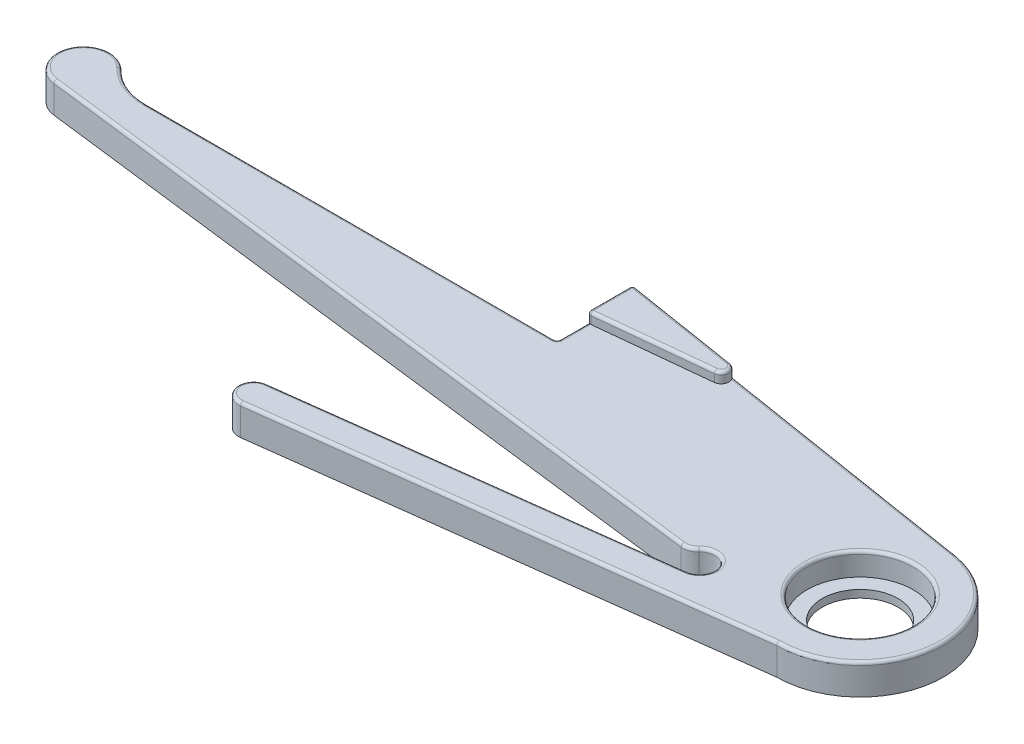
ISO-10303-21;
HEADER;
FILE_DESCRIPTION(('STEP AP214'),'2;1');
FILE_NAME('part.step','',(''),(''),'','','');
FILE_SCHEMA(('AUTOMOTIVE_DESIGN { 1 0 10303 214 1 1 1 1 }'));
ENDSEC;
DATA;
#1=APPLICATION_CONTEXT('core data for automotive mechanical design processes');
#2=APPLICATION_PROTOCOL_DEFINITION('international standard','automotive_design',2000,#1);
#3=PRODUCT_CONTEXT('',#1,'mechanical');
#4=PRODUCT('Part','Part','',(#3));
#5=PRODUCT_RELATED_PRODUCT_CATEGORY('part','',(#4));
#6=PRODUCT_DEFINITION_FORMATION('','',#4);
#7=PRODUCT_DEFINITION_CONTEXT('part definition',#1,'design');
#8=PRODUCT_DEFINITION('design','',#6,#7);
#9=PRODUCT_DEFINITION_SHAPE('','',#8);
#10=(LENGTH_UNIT() NAMED_UNIT(*) SI_UNIT(.MILLI.,.METRE.));
#11=(NAMED_UNIT(*) PLANE_ANGLE_UNIT() SI_UNIT($,.RADIAN.));
#12=(NAMED_UNIT(*) SI_UNIT($,.STERADIAN.) SOLID_ANGLE_UNIT());
#13=UNCERTAINTY_MEASURE_WITH_UNIT(LENGTH_MEASURE(1.E-05),#10,'distance_accuracy_value','');
#14=(GEOMETRIC_REPRESENTATION_CONTEXT(3) GLOBAL_UNCERTAINTY_ASSIGNED_CONTEXT((#13)) GLOBAL_UNIT_ASSIGNED_CONTEXT((#10,
#11,#12)) REPRESENTATION_CONTEXT('',''));
#15=CARTESIAN_POINT('',(0.,0.,0.));
#16=DIRECTION('',(0.,0.,1.));
#17=DIRECTION('',(1.,0.,0.));
#18=AXIS2_PLACEMENT_3D('',#15,#16,#17);
#19=CARTESIAN_POINT('',(0.,0.,0.));
#20=DIRECTION('',(0.,1.,0.));
#21=DIRECTION('',(0.,0.,1.));
#22=AXIS2_PLACEMENT_3D('',#19,#20,#21);
#23=CYLINDRICAL_SURFACE('',#22,5.5);
#24=DIRECTION('',(0.,1.,0.));
#25=VECTOR('',#24,1.);
#26=CARTESIAN_POINT('',(0.871044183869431,0.,-5.43058763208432));
#27=LINE('',#26,#25);
#28=CARTESIAN_POINT('',(0.871044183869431,0.,-5.43058763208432));
#29=VERTEX_POINT('',#28);
#30=CARTESIAN_POINT('',(0.871044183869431,1.8,-5.43058763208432));
#31=VERTEX_POINT('',#30);
#32=EDGE_CURVE('E279',#29,#31,#27,.T.);
#33=ORIENTED_EDGE('',*,*,#32,.T.);
#34=CARTESIAN_POINT('',(0.,1.8,0.));
#35=DIRECTION('',(0.,1.,0.));
#36=DIRECTION('',(0.,0.,1.));
#37=AXIS2_PLACEMENT_3D('',#34,#35,#36);
#38=CIRCLE('',#37,5.5);
#39=CARTESIAN_POINT('',(0.,1.8,5.5));
#40=VERTEX_POINT('',#39);
#41=EDGE_CURVE('E370',#31,#40,#38,.F.);
#42=ORIENTED_EDGE('',*,*,#41,.T.);
#43=DIRECTION('',(0.,1.,0.));
#44=VECTOR('',#43,1.);
#45=CARTESIAN_POINT('',(0.,0.,5.5));
#46=LINE('',#45,#44);
#47=CARTESIAN_POINT('',(0.,0.,5.5));
#48=VERTEX_POINT('',#47);
#49=EDGE_CURVE('E280',#48,#40,#46,.T.);
#50=ORIENTED_EDGE('',*,*,#49,.F.);
#51=CARTESIAN_POINT('',(0.,0.,0.));
#52=DIRECTION('',(0.,1.,0.));
#53=DIRECTION('',(0.,0.,1.));
#54=AXIS2_PLACEMENT_3D('',#51,#52,#53);
#55=CIRCLE('',#54,5.5);
#56=EDGE_CURVE('E248',#48,#29,#55,.T.);
#57=ORIENTED_EDGE('',*,*,#56,.T.);
#58=EDGE_LOOP('',(#33,#42,#50,#57));
#59=FACE_BOUND('',#58,.T.);
#60=ADVANCED_FACE('F33',(#59),#23,.T.);
#61=CARTESIAN_POINT('',(-31.3815854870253,0.,9.5));
#62=DIRECTION('',(0.126440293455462,0.,0.991974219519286));
#63=DIRECTION('',(0.991974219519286,0.,-0.126440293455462));
#64=AXIS2_PLACEMENT_3D('',#61,#62,#63);
#65=PLANE('',#64);
#66=ORIENTED_EDGE('',*,*,#49,.T.);
#67=DIRECTION('',(0.991974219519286,0.,-0.126440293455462));
#68=VECTOR('',#67,1.);
#69=CARTESIAN_POINT('',(-31.3815854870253,1.8,9.5));
#70=LINE('',#69,#68);
#71=CARTESIAN_POINT('',(-31.3815854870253,1.8,9.5));
#72=VERTEX_POINT('',#71);
#73=EDGE_CURVE('E372',#40,#72,#70,.F.);
#74=ORIENTED_EDGE('',*,*,#73,.T.);
#75=DIRECTION('',(0.,1.,0.));
#76=VECTOR('',#75,1.);
#77=CARTESIAN_POINT('',(-31.3815854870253,0.,9.5));
#78=LINE('',#77,#76);
#79=CARTESIAN_POINT('',(-31.3815854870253,0.,9.5));
#80=VERTEX_POINT('',#79);
#81=EDGE_CURVE('E284',#80,#72,#78,.T.);
#82=ORIENTED_EDGE('',*,*,#81,.F.);
#83=DIRECTION('',(0.991974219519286,0.,-0.126440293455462));
#84=VECTOR('',#83,1.);
#85=CARTESIAN_POINT('',(-31.3815854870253,0.,9.5));
#86=LINE('',#85,#84);
#87=EDGE_CURVE('E276',#80,#48,#86,.T.);
#88=ORIENTED_EDGE('',*,*,#87,.T.);
#89=EDGE_LOOP('',(#66,#74,#82,#88));
#90=FACE_BOUND('',#89,.T.);
#91=ADVANCED_FACE('F508',(#90),#65,.T.);
#92=CARTESIAN_POINT('',(-31.5080257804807,0.,8.50802578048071));
#93=DIRECTION('',(0.,1.,0.));
#94=DIRECTION('',(0.,0.,1.));
#95=AXIS2_PLACEMENT_3D('',#92,#93,#94);
#96=CYLINDRICAL_SURFACE('',#95,1.);
#97=ORIENTED_EDGE('',*,*,#81,.T.);
#98=CARTESIAN_POINT('',(-31.5080257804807,1.8,8.50802578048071));
#99=DIRECTION('',(0.,1.,0.));
#100=DIRECTION('',(0.,0.,1.));
#101=AXIS2_PLACEMENT_3D('',#98,#99,#100);
#102=CIRCLE('',#101,1.);
#103=CARTESIAN_POINT('',(-31.6344660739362,1.8,7.51605156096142));
#104=VERTEX_POINT('',#103);
#105=EDGE_CURVE('E374',#72,#104,#102,.F.);
#106=ORIENTED_EDGE('',*,*,#105,.T.);
#107=DIRECTION('',(0.,1.,0.));
#108=VECTOR('',#107,1.);
#109=CARTESIAN_POINT('',(-31.6344660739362,0.,7.51605156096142));
#110=LINE('',#109,#108);
#111=CARTESIAN_POINT('',(-31.6344660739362,0.,7.51605156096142));
#112=VERTEX_POINT('',#111);
#113=EDGE_CURVE('E287',#112,#104,#110,.T.);
#114=ORIENTED_EDGE('',*,*,#113,.F.);
#115=CARTESIAN_POINT('',(-31.5080257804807,0.,8.50802578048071));
#116=DIRECTION('',(0.,1.,0.));
#117=DIRECTION('',(0.,0.,1.));
#118=AXIS2_PLACEMENT_3D('',#115,#116,#117);
#119=CIRCLE('',#118,1.);
#120=EDGE_CURVE('E273',#112,#80,#119,.T.);
#121=ORIENTED_EDGE('',*,*,#120,.T.);
#122=EDGE_LOOP('',(#97,#106,#114,#121));
#123=FACE_BOUND('',#122,.T.);
#124=ADVANCED_FACE('F521',(#123),#96,.T.);
#125=CARTESIAN_POINT('',(-7.06735245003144,0.,4.38464653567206));
#126=DIRECTION('',(-0.126440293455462,0.,-0.991974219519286));
#127=DIRECTION('',(-0.991974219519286,0.,0.126440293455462));
#128=AXIS2_PLACEMENT_3D('',#125,#126,#127);
#129=PLANE('',#128);
#130=ORIENTED_EDGE('',*,*,#113,.T.);
#131=DIRECTION('',(-0.991974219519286,0.,0.126440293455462));
#132=VECTOR('',#131,1.);
#133=CARTESIAN_POINT('',(-7.06735245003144,1.8,4.38464653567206));
#134=LINE('',#133,#132);
#135=CARTESIAN_POINT('',(-7.06735245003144,1.8,4.38464653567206));
#136=VERTEX_POINT('',#135);
#137=EDGE_CURVE('E376',#104,#136,#134,.F.);
#138=ORIENTED_EDGE('',*,*,#137,.T.);
#139=DIRECTION('',(0.,1.,0.));
#140=VECTOR('',#139,1.);
#141=CARTESIAN_POINT('',(-7.06735245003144,0.,4.38464653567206));
#142=LINE('',#141,#140);
#143=CARTESIAN_POINT('',(-7.06735245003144,0.,4.38464653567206));
#144=VERTEX_POINT('',#143);
#145=EDGE_CURVE('E290',#144,#136,#142,.T.);
#146=ORIENTED_EDGE('',*,*,#145,.F.);
#147=DIRECTION('',(-0.991974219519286,0.,0.126440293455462));
#148=VECTOR('',#147,1.);
#149=CARTESIAN_POINT('',(-7.06735245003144,0.,4.38464653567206));
#150=LINE('',#149,#148);
#151=EDGE_CURVE('E270',#144,#112,#150,.T.);
#152=ORIENTED_EDGE('',*,*,#151,.T.);
#153=EDGE_LOOP('',(#130,#138,#146,#152));
#154=FACE_BOUND('',#153,.T.);
#155=ADVANCED_FACE('F524',(#154),#129,.T.);
#156=CARTESIAN_POINT('',(-7.1937927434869,0.,3.39267231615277));
#157=DIRECTION('',(0.,1.,0.));
#158=DIRECTION('',(0.,0.,1.));
#159=AXIS2_PLACEMENT_3D('',#156,#157,#158);
#160=CYLINDRICAL_SURFACE('',#159,1.);
#161=ORIENTED_EDGE('',*,*,#145,.T.);
#162=CARTESIAN_POINT('',(-7.1937927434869,1.8,3.39267231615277));
#163=DIRECTION('',(0.,1.,0.));
#164=DIRECTION('',(0.,0.,1.));
#165=AXIS2_PLACEMENT_3D('',#162,#163,#164);
#166=CIRCLE('',#165,1.);
#167=CARTESIAN_POINT('',(-7.92714766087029,1.8,2.71282632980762));
#168=VERTEX_POINT('',#167);
#169=EDGE_CURVE('E378',#136,#168,#166,.T.);
#170=ORIENTED_EDGE('',*,*,#169,.T.);
#171=DIRECTION('',(0.,1.,0.));
#172=VECTOR('',#171,1.);
#173=CARTESIAN_POINT('',(-7.92714766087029,0.,2.71282632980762));
#174=LINE('',#173,#172);
#175=CARTESIAN_POINT('',(-7.92714766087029,0.,2.71282632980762));
#176=VERTEX_POINT('',#175);
#177=EDGE_CURVE('E293',#176,#168,#174,.T.);
#178=ORIENTED_EDGE('',*,*,#177,.F.);
#179=CARTESIAN_POINT('',(-7.1937927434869,0.,3.39267231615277));
#180=DIRECTION('',(0.,-1.,0.));
#181=DIRECTION('',(0.,0.,-1.));
#182=AXIS2_PLACEMENT_3D('',#179,#180,#181);
#183=CIRCLE('',#182,1.);
#184=EDGE_CURVE('E267',#176,#144,#183,.T.);
#185=ORIENTED_EDGE('',*,*,#184,.T.);
#186=EDGE_LOOP('',(#161,#170,#178,#185));
#187=FACE_BOUND('',#186,.T.);
#188=ADVANCED_FACE('F529',(#187),#160,.F.);
#189=CARTESIAN_POINT('',(-8.66050257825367,0.,2.03298034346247));
#190=DIRECTION('',(0.,1.,0.));
#191=DIRECTION('',(0.,0.,1.));
#192=AXIS2_PLACEMENT_3D('',#189,#190,#191);
#193=CYLINDRICAL_SURFACE('',#192,0.999999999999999);
#194=ORIENTED_EDGE('',*,*,#177,.T.);
#195=CARTESIAN_POINT('',(-8.66050257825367,1.8,2.03298034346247));
#196=DIRECTION('',(0.,1.,0.));
#197=DIRECTION('',(0.,0.,1.));
#198=AXIS2_PLACEMENT_3D('',#195,#196,#197);
#199=CIRCLE('',#198,0.999999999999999);
#200=CARTESIAN_POINT('',(-8.78237192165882,1.8,3.02552649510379));
#201=VERTEX_POINT('',#200);
#202=EDGE_CURVE('E380',#168,#201,#199,.F.);
#203=ORIENTED_EDGE('',*,*,#202,.T.);
#204=DIRECTION('',(0.,1.,0.));
#205=VECTOR('',#204,1.);
#206=CARTESIAN_POINT('',(-8.78237192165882,0.,3.02552649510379));
#207=LINE('',#206,#205);
#208=CARTESIAN_POINT('',(-8.78237192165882,0.,3.02552649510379));
#209=VERTEX_POINT('',#208);
#210=EDGE_CURVE('E296',#209,#201,#207,.T.);
#211=ORIENTED_EDGE('',*,*,#210,.F.);
#212=CARTESIAN_POINT('',(-8.66050257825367,0.,2.03298034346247));
#213=DIRECTION('',(0.,1.,0.));
#214=DIRECTION('',(0.,0.,1.));
#215=AXIS2_PLACEMENT_3D('',#212,#213,#214);
#216=CIRCLE('',#215,0.999999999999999);
#217=EDGE_CURVE('E264',#209,#176,#216,.T.);
#218=ORIENTED_EDGE('',*,*,#217,.T.);
#219=EDGE_LOOP('',(#194,#203,#211,#218));
#220=FACE_BOUND('',#219,.T.);
#221=ADVANCED_FACE('F534',(#220),#193,.T.);
#222=CARTESIAN_POINT('',(-55.963271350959,0.,-2.7675595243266));
#223=DIRECTION('',(-0.121869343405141,0.,0.992546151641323));
#224=DIRECTION('',(0.992546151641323,0.,0.121869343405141));
#225=AXIS2_PLACEMENT_3D('',#222,#223,#224);
#226=PLANE('',#225);
#227=ORIENTED_EDGE('',*,*,#210,.T.);
#228=DIRECTION('',(0.992546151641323,0.,0.121869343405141));
#229=VECTOR('',#228,1.);
#230=CARTESIAN_POINT('',(-55.963271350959,1.8,-2.7675595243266));
#231=LINE('',#230,#229);
#232=CARTESIAN_POINT('',(-55.963271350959,1.8,-2.76755952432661));
#233=VERTEX_POINT('',#232);
#234=EDGE_CURVE('E382',#201,#233,#231,.F.);
#235=ORIENTED_EDGE('',*,*,#234,.T.);
#236=DIRECTION('',(0.,1.,0.));
#237=VECTOR('',#236,1.);
#238=CARTESIAN_POINT('',(-55.963271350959,0.,-2.76755952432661));
#239=LINE('',#238,#237);
#240=CARTESIAN_POINT('',(-55.963271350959,0.,-2.76755952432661));
#241=VERTEX_POINT('',#240);
#242=EDGE_CURVE('E299',#241,#233,#239,.T.);
#243=ORIENTED_EDGE('',*,*,#242,.F.);
#244=DIRECTION('',(0.992546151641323,0.,0.121869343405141));
#245=VECTOR('',#244,1.);
#246=CARTESIAN_POINT('',(-55.963271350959,0.,-2.7675595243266));
#247=LINE('',#246,#245);
#248=EDGE_CURVE('E261',#241,#209,#247,.T.);
#249=ORIENTED_EDGE('',*,*,#248,.T.);
#250=EDGE_LOOP('',(#227,#235,#243,#249));
#251=FACE_BOUND('',#250,.T.);
#252=ADVANCED_FACE('F551',(#251),#226,.T.);
#253=CARTESIAN_POINT('',(-55.75,0.,-4.50451528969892));
#254=DIRECTION('',(0.,1.,0.));
#255=DIRECTION('',(0.,0.,1.));
#256=AXIS2_PLACEMENT_3D('',#253,#254,#255);
#257=CYLINDRICAL_SURFACE('',#256,1.75);
#258=ORIENTED_EDGE('',*,*,#242,.T.);
#259=CARTESIAN_POINT('',(-55.75,1.8,-4.50451528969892));
#260=DIRECTION('',(0.,1.,0.));
#261=DIRECTION('',(0.,0.,1.));
#262=AXIS2_PLACEMENT_3D('',#259,#260,#261);
#263=CIRCLE('',#262,1.75);
#264=CARTESIAN_POINT('',(-54.4915078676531,1.8,-5.72053237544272));
#265=VERTEX_POINT('',#264);
#266=EDGE_CURVE('E384',#233,#265,#263,.F.);
#267=ORIENTED_EDGE('',*,*,#266,.T.);
#268=DIRECTION('',(0.,1.,0.));
#269=VECTOR('',#268,1.);
#270=CARTESIAN_POINT('',(-54.4915078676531,0.,-5.72053237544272));
#271=LINE('',#270,#269);
#272=CARTESIAN_POINT('',(-54.4915078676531,0.,-5.72053237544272));
#273=VERTEX_POINT('',#272);
#274=EDGE_CURVE('E305',#265,#273,#271,.F.);
#275=ORIENTED_EDGE('',*,*,#274,.T.);
#276=CARTESIAN_POINT('',(-55.75,0.,-4.50451528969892));
#277=DIRECTION('',(0.,1.,0.));
#278=DIRECTION('',(0.,0.,1.));
#279=AXIS2_PLACEMENT_3D('',#276,#277,#278);
#280=CIRCLE('',#279,1.75);
#281=EDGE_CURVE('E259',#273,#241,#280,.T.);
#282=ORIENTED_EDGE('',*,*,#281,.T.);
#283=EDGE_LOOP('',(#258,#267,#275,#282));
#284=FACE_BOUND('',#283,.T.);
#285=ADVANCED_FACE('F554',(#284),#257,.T.);
#286=CARTESIAN_POINT('',(-24.5,0.,-4.49999999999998));
#287=DIRECTION('',(0.,0.,-1.));
#288=DIRECTION('',(-1.,0.,0.));
#289=AXIS2_PLACEMENT_3D('',#286,#287,#288);
#290=PLANE('',#289);
#291=DIRECTION('',(0.,-1.,0.));
#292=VECTOR('',#291,1.);
#293=CARTESIAN_POINT('',(-51.6149544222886,2.,-4.49999999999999));
#294=LINE('',#293,#292);
#295=CARTESIAN_POINT('',(-51.6149544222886,0.,-4.49999999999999));
#296=VERTEX_POINT('',#295);
#297=CARTESIAN_POINT('',(-51.6149544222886,1.8,-4.49999999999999));
#298=VERTEX_POINT('',#297);
#299=EDGE_CURVE('E283',#296,#298,#294,.F.);
#300=ORIENTED_EDGE('',*,*,#299,.T.);
#301=DIRECTION('',(-1.,0.,0.));
#302=VECTOR('',#301,1.);
#303=CARTESIAN_POINT('',(-24.5,1.8,-4.49999999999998));
#304=LINE('',#303,#302);
#305=CARTESIAN_POINT('',(-24.7,1.8,-4.49999999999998));
#306=VERTEX_POINT('',#305);
#307=EDGE_CURVE('E58',#298,#306,#304,.F.);
#308=ORIENTED_EDGE('',*,*,#307,.T.);
#309=DIRECTION('',(0.,1.,0.));
#310=VECTOR('',#309,1.);
#311=CARTESIAN_POINT('',(-24.7,0.,-4.49999999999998));
#312=LINE('',#311,#310);
#313=CARTESIAN_POINT('',(-24.7,0.,-4.49999999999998));
#314=VERTEX_POINT('',#313);
#315=EDGE_CURVE('E388',#306,#314,#312,.F.);
#316=ORIENTED_EDGE('',*,*,#315,.T.);
#317=DIRECTION('',(-1.,0.,0.));
#318=VECTOR('',#317,1.);
#319=CARTESIAN_POINT('',(-24.5,0.,-4.49999999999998));
#320=LINE('',#319,#318);
#321=EDGE_CURVE('E257',#314,#296,#320,.T.);
#322=ORIENTED_EDGE('',*,*,#321,.T.);
#323=EDGE_LOOP('',(#300,#308,#316,#322));
#324=FACE_BOUND('',#323,.T.);
#325=ADVANCED_FACE('F564',(#324),#290,.T.);
#326=CARTESIAN_POINT('',(-24.5,0.,-9.49999999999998));
#327=DIRECTION('',(-1.,0.,0.));
#328=DIRECTION('',(0.,0.,1.));
#329=AXIS2_PLACEMENT_3D('',#326,#327,#328);
#330=PLANE('',#329);
#331=DIRECTION('',(0.,0.,1.));
#332=VECTOR('',#331,1.);
#333=CARTESIAN_POINT('',(-24.5,2.5,-9.49999999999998));
#334=LINE('',#333,#332);
#335=CARTESIAN_POINT('',(-24.5,2.5,-6.7216848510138));
#336=VERTEX_POINT('',#335);
#337=CARTESIAN_POINT('',(-24.5,2.5,-9.26536446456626));
#338=VERTEX_POINT('',#337);
#339=EDGE_CURVE('E323',#336,#338,#334,.F.);
#340=ORIENTED_EDGE('',*,*,#339,.T.);
#341=DIRECTION('',(0.,1.,0.));
#342=VECTOR('',#341,1.);
#343=CARTESIAN_POINT('',(-24.5,0.,-9.26536446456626));
#344=LINE('',#343,#342);
#345=CARTESIAN_POINT('',(-24.5,0.,-9.26536446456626));
#346=VERTEX_POINT('',#345);
#347=EDGE_CURVE('E325',#338,#346,#344,.F.);
#348=ORIENTED_EDGE('',*,*,#347,.T.);
#349=DIRECTION('',(0.,0.,1.));
#350=VECTOR('',#349,1.);
#351=CARTESIAN_POINT('',(-24.5,0.,-9.49999999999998));
#352=LINE('',#351,#350);
#353=CARTESIAN_POINT('',(-24.5,0.,-4.69999999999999));
#354=VERTEX_POINT('',#353);
#355=EDGE_CURVE('E254',#346,#354,#352,.T.);
#356=ORIENTED_EDGE('',*,*,#355,.T.);
#357=DIRECTION('',(0.,1.,0.));
#358=VECTOR('',#357,1.);
#359=CARTESIAN_POINT('',(-24.5,2.,-4.69999999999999));
#360=LINE('',#359,#358);
#361=CARTESIAN_POINT('',(-24.5,1.8,-4.69999999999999));
#362=VERTEX_POINT('',#361);
#363=EDGE_CURVE('E317',#354,#362,#360,.T.);
#364=ORIENTED_EDGE('',*,*,#363,.T.);
#365=DIRECTION('',(0.,0.,1.));
#366=VECTOR('',#365,1.);
#367=CARTESIAN_POINT('',(-24.5,1.8,-9.49999999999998));
#368=LINE('',#367,#366);
#369=CARTESIAN_POINT('',(-24.5,1.8,-6.7216848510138));
#370=VERTEX_POINT('',#369);
#371=EDGE_CURVE('E319',#362,#370,#368,.F.);
#372=ORIENTED_EDGE('',*,*,#371,.T.);
#373=DIRECTION('',(0.,-1.,0.));
#374=VECTOR('',#373,1.);
#375=CARTESIAN_POINT('',(-24.5,2.7,-6.7216848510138));
#376=LINE('',#375,#374);
#377=EDGE_CURVE('E321',#370,#336,#376,.F.);
#378=ORIENTED_EDGE('',*,*,#377,.T.);
#379=EDGE_LOOP('',(#340,#348,#356,#364,#372,#378));
#380=FACE_BOUND('',#379,.T.);
#381=ADVANCED_FACE('F582',(#380),#330,.T.);
#382=CARTESIAN_POINT('',(0.871044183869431,0.,-5.43058763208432));
#383=DIRECTION('',(0.158371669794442,0.,-0.987379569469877));
#384=DIRECTION('',(-0.987379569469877,0.,-0.158371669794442));
#385=AXIS2_PLACEMENT_3D('',#382,#383,#384);
#386=PLANE('',#385);
#387=DIRECTION('',(-0.987379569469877,0.,-0.158371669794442));
#388=VECTOR('',#387,1.);
#389=CARTESIAN_POINT('',(0.871044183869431,0.,-5.43058763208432));
#390=LINE('',#389,#388);
#391=CARTESIAN_POINT('',(-24.2683256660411,0.,-9.46284037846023));
#392=VERTEX_POINT('',#391);
#393=EDGE_CURVE('E251',#29,#392,#390,.T.);
#394=ORIENTED_EDGE('',*,*,#393,.T.);
#395=DIRECTION('',(0.,1.,0.));
#396=VECTOR('',#395,1.);
#397=CARTESIAN_POINT('',(-24.2683256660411,0.,-9.46284037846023));
#398=LINE('',#397,#396);
#399=CARTESIAN_POINT('',(-24.2683256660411,2.5,-9.46284037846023));
#400=VERTEX_POINT('',#399);
#401=EDGE_CURVE('E314',#392,#400,#398,.T.);
#402=ORIENTED_EDGE('',*,*,#401,.T.);
#403=DIRECTION('',(-0.987379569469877,0.,-0.158371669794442));
#404=VECTOR('',#403,1.);
#405=CARTESIAN_POINT('',(-16.8654921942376,2.5,-8.27545597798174));
#406=LINE('',#405,#404);
#407=CARTESIAN_POINT('',(-16.8654921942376,2.5,-8.27545597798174));
#408=VERTEX_POINT('',#407);
#409=EDGE_CURVE('E312',#400,#408,#406,.F.);
#410=ORIENTED_EDGE('',*,*,#409,.T.);
#411=DIRECTION('',(0.,-1.,0.));
#412=VECTOR('',#411,1.);
#413=CARTESIAN_POINT('',(-16.8654921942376,2.7,-8.27545597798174));
#414=LINE('',#413,#412);
#415=CARTESIAN_POINT('',(-16.8654921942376,1.8,-8.27545597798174));
#416=VERTEX_POINT('',#415);
#417=EDGE_CURVE('E227',#408,#416,#414,.T.);
#418=ORIENTED_EDGE('',*,*,#417,.T.);
#419=DIRECTION('',(-0.987379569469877,0.,-0.158371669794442));
#420=VECTOR('',#419,1.);
#421=CARTESIAN_POINT('',(0.871044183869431,1.8,-5.43058763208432));
#422=LINE('',#421,#420);
#423=EDGE_CURVE('E310',#416,#31,#422,.F.);
#424=ORIENTED_EDGE('',*,*,#423,.T.);
#425=ORIENTED_EDGE('',*,*,#32,.F.);
#426=EDGE_LOOP('',(#394,#402,#410,#418,#424,#425));
#427=FACE_BOUND('',#426,.T.);
#428=ADVANCED_FACE('F496',(#427),#386,.T.);
#429=CARTESIAN_POINT('',(0.,0.,0.));
#430=DIRECTION('',(0.,1.,0.));
#431=DIRECTION('',(0.,0.,1.));
#432=AXIS2_PLACEMENT_3D('',#429,#430,#431);
#433=PLANE('',#432);
#434=CARTESIAN_POINT('',(0.,0.,0.));
#435=DIRECTION('',(0.,1.,0.));
#436=DIRECTION('',(0.,0.,1.));
#437=AXIS2_PLACEMENT_3D('',#434,#435,#436);
#438=CIRCLE('',#437,2.50000000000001);
#439=CARTESIAN_POINT('',(0.,0.,2.50000000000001));
#440=VERTEX_POINT('',#439);
#441=EDGE_CURVE('E240',#440,#440,#438,.T.);
#442=ORIENTED_EDGE('',*,*,#441,.T.);
#443=EDGE_LOOP('',(#442));
#444=FACE_BOUND('',#443,.T.);
#445=ORIENTED_EDGE('',*,*,#355,.F.);
#446=CARTESIAN_POINT('',(-24.3,0.,-9.26536446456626));
#447=DIRECTION('',(0.,1.,0.));
#448=DIRECTION('',(0.,0.,1.));
#449=AXIS2_PLACEMENT_3D('',#446,#447,#448);
#450=CIRCLE('',#449,0.2);
#451=EDGE_CURVE('E327',#346,#392,#450,.F.);
#452=ORIENTED_EDGE('',*,*,#451,.T.);
#453=ORIENTED_EDGE('',*,*,#393,.F.);
#454=ORIENTED_EDGE('',*,*,#56,.F.);
#455=ORIENTED_EDGE('',*,*,#87,.F.);
#456=ORIENTED_EDGE('',*,*,#120,.F.);
#457=ORIENTED_EDGE('',*,*,#151,.F.);
#458=ORIENTED_EDGE('',*,*,#184,.F.);
#459=ORIENTED_EDGE('',*,*,#217,.F.);
#460=ORIENTED_EDGE('',*,*,#248,.F.);
#461=ORIENTED_EDGE('',*,*,#281,.F.);
#462=CARTESIAN_POINT('',(-51.6149544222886,0.,-8.49999999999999));
#463=DIRECTION('',(0.,1.,0.));
#464=DIRECTION('',(0.,0.,1.));
#465=AXIS2_PLACEMENT_3D('',#462,#463,#464);
#466=CIRCLE('',#465,4.);
#467=EDGE_CURVE('E307',#273,#296,#466,.T.);
#468=ORIENTED_EDGE('',*,*,#467,.T.);
#469=ORIENTED_EDGE('',*,*,#321,.F.);
#470=CARTESIAN_POINT('',(-24.7,0.,-4.69999999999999));
#471=DIRECTION('',(0.,1.,0.));
#472=DIRECTION('',(0.,0.,1.));
#473=AXIS2_PLACEMENT_3D('',#470,#471,#472);
#474=CIRCLE('',#473,0.2);
#475=EDGE_CURVE('E11',#314,#354,#474,.T.);
#476=ORIENTED_EDGE('',*,*,#475,.T.);
#477=EDGE_LOOP('',(#445,#452,#453,#454,#455,#456,#457,#458,#459,#460,#461,#468,#469,#476));
#478=FACE_BOUND('',#477,.T.);
#479=ADVANCED_FACE('F501',(#444,#478),#433,.F.);
#480=CARTESIAN_POINT('',(0.,2.,0.));
#481=DIRECTION('',(0.,1.,0.));
#482=DIRECTION('',(0.,0.,1.));
#483=AXIS2_PLACEMENT_3D('',#480,#481,#482);
#484=PLANE('',#483);
#485=CARTESIAN_POINT('',(0.,2.,0.));
#486=DIRECTION('',(0.,1.,0.));
#487=DIRECTION('',(0.,0.,1.));
#488=AXIS2_PLACEMENT_3D('',#485,#486,#487);
#489=CIRCLE('',#488,3.7);
#490=CARTESIAN_POINT('',(0.,2.,3.7));
#491=VERTEX_POINT('',#490);
#492=EDGE_CURVE('E342',#491,#491,#489,.F.);
#493=ORIENTED_EDGE('',*,*,#492,.T.);
#494=EDGE_LOOP('',(#493));
#495=FACE_BOUND('',#494,.T.);
#496=CARTESIAN_POINT('',(0.,2.,0.));
#497=DIRECTION('',(0.,1.,0.));
#498=DIRECTION('',(0.,0.,1.));
#499=AXIS2_PLACEMENT_3D('',#496,#497,#498);
#500=CIRCLE('',#499,5.3);
#501=CARTESIAN_POINT('',(-0.0125778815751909,2.,5.29998507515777));
#502=VERTEX_POINT('',#501);
#503=CARTESIAN_POINT('',(0.839369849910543,2.,-5.23311171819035));
#504=VERTEX_POINT('',#503);
#505=EDGE_CURVE('E367',#502,#504,#500,.T.);
#506=ORIENTED_EDGE('',*,*,#505,.T.);
#507=DIRECTION('',(-0.987379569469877,0.,-0.158371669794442));
#508=VECTOR('',#507,1.);
#509=CARTESIAN_POINT('',(0.839369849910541,2.,-5.23311171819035));
#510=LINE('',#509,#508);
#511=CARTESIAN_POINT('',(-16.5022147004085,2.,-8.01463139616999));
#512=VERTEX_POINT('',#511);
#513=EDGE_CURVE('E239',#504,#512,#510,.T.);
#514=ORIENTED_EDGE('',*,*,#513,.T.);
#515=CARTESIAN_POINT('',(-16.9446780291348,2.,-7.7817661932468));
#516=DIRECTION('',(0.,1.,0.));
#517=DIRECTION('',(0.,0.,-1.));
#518=AXIS2_PLACEMENT_3D('',#515,#516,#517);
#519=CIRCLE('',#518,0.499999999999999);
#520=CARTESIAN_POINT('',(-16.8933893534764,2.,-7.28440367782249));
#521=VERTEX_POINT('',#520);
#522=EDGE_CURVE('E221',#521,#512,#519,.T.);
#523=ORIENTED_EDGE('',*,*,#522,.F.);
#524=DIRECTION('',(0.994725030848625,0.,-0.102577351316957));
#525=VECTOR('',#524,1.);
#526=CARTESIAN_POINT('',(-16.8933893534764,2.,-7.28440367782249));
#527=LINE('',#526,#525);
#528=CARTESIAN_POINT('',(-24.2794845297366,2.,-6.52273984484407));
#529=VERTEX_POINT('',#528);
#530=EDGE_CURVE('E228',#529,#521,#527,.T.);
#531=ORIENTED_EDGE('',*,*,#530,.F.);
#532=CARTESIAN_POINT('',(-24.3,2.,-6.7216848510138));
#533=DIRECTION('',(0.,1.,0.));
#534=DIRECTION('',(0.,0.,1.));
#535=AXIS2_PLACEMENT_3D('',#532,#533,#534);
#536=CIRCLE('',#535,0.2);
#537=CARTESIAN_POINT('',(-24.3,2.,-6.5216848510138));
#538=VERTEX_POINT('',#537);
#539=EDGE_CURVE('E42',#529,#538,#536,.F.);
#540=ORIENTED_EDGE('',*,*,#539,.T.);
#541=DIRECTION('',(0.,0.,1.));
#542=VECTOR('',#541,1.);
#543=CARTESIAN_POINT('',(-24.3,2.,0.));
#544=LINE('',#543,#542);
#545=CARTESIAN_POINT('',(-24.3,2.,-4.69999999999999));
#546=VERTEX_POINT('',#545);
#547=EDGE_CURVE('E50',#538,#546,#544,.T.);
#548=ORIENTED_EDGE('',*,*,#547,.T.);
#549=CARTESIAN_POINT('',(-24.7,2.,-4.69999999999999));
#550=DIRECTION('',(0.,1.,0.));
#551=DIRECTION('',(0.,0.,1.));
#552=AXIS2_PLACEMENT_3D('',#549,#550,#551);
#553=CIRCLE('',#552,0.4);
#554=CARTESIAN_POINT('',(-24.7,2.,-4.29999999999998));
#555=VERTEX_POINT('',#554);
#556=EDGE_CURVE('E345',#555,#546,#553,.T.);
#557=ORIENTED_EDGE('',*,*,#556,.F.);
#558=DIRECTION('',(-1.,0.,0.));
#559=VECTOR('',#558,1.);
#560=CARTESIAN_POINT('',(0.,2.,-4.29999999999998));
#561=LINE('',#560,#559);
#562=CARTESIAN_POINT('',(-51.6149544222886,2.,-4.29999999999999));
#563=VERTEX_POINT('',#562);
#564=EDGE_CURVE('E349',#555,#563,#561,.T.);
#565=ORIENTED_EDGE('',*,*,#564,.T.);
#566=CARTESIAN_POINT('',(-51.6149544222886,2.,-8.49999999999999));
#567=DIRECTION('',(0.,1.,0.));
#568=DIRECTION('',(0.,0.,1.));
#569=AXIS2_PLACEMENT_3D('',#566,#567,#568);
#570=CIRCLE('',#569,4.2);
#571=CARTESIAN_POINT('',(-54.6353355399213,2.,-5.58155899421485));
#572=VERTEX_POINT('',#571);
#573=EDGE_CURVE('E351',#563,#572,#570,.F.);
#574=ORIENTED_EDGE('',*,*,#573,.T.);
#575=CARTESIAN_POINT('',(-55.75,2.,-4.50451528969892));
#576=DIRECTION('',(0.,1.,0.));
#577=DIRECTION('',(0.,0.,1.));
#578=AXIS2_PLACEMENT_3D('',#575,#576,#577);
#579=CIRCLE('',#578,1.55);
#580=CARTESIAN_POINT('',(-55.938897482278,2.,-2.96606875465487));
#581=VERTEX_POINT('',#580);
#582=EDGE_CURVE('E353',#572,#581,#579,.T.);
#583=ORIENTED_EDGE('',*,*,#582,.T.);
#584=DIRECTION('',(0.992546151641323,0.,0.121869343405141));
#585=VECTOR('',#584,1.);
#586=CARTESIAN_POINT('',(-0.472033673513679,2.,3.84440576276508));
#587=LINE('',#586,#585);
#588=CARTESIAN_POINT('',(-8.75799805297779,2.,2.82701726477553));
#589=VERTEX_POINT('',#588);
#590=EDGE_CURVE('E355',#581,#589,#587,.T.);
#591=ORIENTED_EDGE('',*,*,#590,.T.);
#592=CARTESIAN_POINT('',(-8.66050257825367,2.,2.03298034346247));
#593=DIRECTION('',(0.,1.,0.));
#594=DIRECTION('',(0.,0.,1.));
#595=AXIS2_PLACEMENT_3D('',#592,#593,#594);
#596=CIRCLE('',#595,0.799999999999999);
#597=CARTESIAN_POINT('',(-8.07381864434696,2.,2.57685713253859));
#598=VERTEX_POINT('',#597);
#599=EDGE_CURVE('E357',#589,#598,#596,.T.);
#600=ORIENTED_EDGE('',*,*,#599,.T.);
#601=CARTESIAN_POINT('',(-7.1937927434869,2.,3.39267231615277));
#602=DIRECTION('',(0.,1.,0.));
#603=DIRECTION('',(0.,0.,1.));
#604=AXIS2_PLACEMENT_3D('',#601,#602,#603);
#605=CIRCLE('',#604,1.2);
#606=CARTESIAN_POINT('',(-7.04206439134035,2.,4.58304137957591));
#607=VERTEX_POINT('',#606);
#608=EDGE_CURVE('E359',#598,#607,#605,.F.);
#609=ORIENTED_EDGE('',*,*,#608,.T.);
#610=DIRECTION('',(-0.991974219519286,0.,0.126440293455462));
#611=VECTOR('',#610,1.);
#612=CARTESIAN_POINT('',(0.462247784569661,2.,3.62651709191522));
#613=LINE('',#612,#611);
#614=CARTESIAN_POINT('',(-31.6091780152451,2.,7.71444640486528));
#615=VERTEX_POINT('',#614);
#616=EDGE_CURVE('E361',#607,#615,#613,.T.);
#617=ORIENTED_EDGE('',*,*,#616,.T.);
#618=CARTESIAN_POINT('',(-31.5080257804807,2.,8.50802578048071));
#619=DIRECTION('',(0.,1.,0.));
#620=DIRECTION('',(0.,0.,1.));
#621=AXIS2_PLACEMENT_3D('',#618,#619,#620);
#622=CIRCLE('',#621,0.800000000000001);
#623=CARTESIAN_POINT('',(-31.4068735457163,2.,9.30160515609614));
#624=VERTEX_POINT('',#623);
#625=EDGE_CURVE('E363',#615,#624,#622,.T.);
#626=ORIENTED_EDGE('',*,*,#625,.T.);
#627=DIRECTION('',(0.991974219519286,0.,-0.126440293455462));
#628=VECTOR('',#627,1.);
#629=CARTESIAN_POINT('',(0.664552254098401,2.,5.21367584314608));
#630=LINE('',#629,#628);
#631=EDGE_CURVE('E365',#624,#502,#630,.T.);
#632=ORIENTED_EDGE('',*,*,#631,.T.);
#633=EDGE_LOOP('',(#506,#514,#523,#531,#540,#548,#557,#565,#574,#583,#591,#600,#609,#617,#626,#632));
#634=FACE_BOUND('',#633,.T.);
#635=ADVANCED_FACE('F237',(#495,#634),#484,.T.);
#636=CARTESIAN_POINT('',(-16.9446780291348,2.7,-7.7817661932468));
#637=DIRECTION('',(0.,-1.,0.));
#638=DIRECTION('',(0.,0.,-1.));
#639=AXIS2_PLACEMENT_3D('',#636,#637,#638);
#640=CYLINDRICAL_SURFACE('',#639,0.499999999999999);
#641=ORIENTED_EDGE('',*,*,#417,.F.);
#642=CARTESIAN_POINT('',(-16.9446780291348,2.5,-7.7817661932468));
#643=DIRECTION('',(0.,-1.,0.));
#644=DIRECTION('',(0.,0.,-1.));
#645=AXIS2_PLACEMENT_3D('',#642,#643,#644);
#646=CIRCLE('',#645,0.499999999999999);
#647=CARTESIAN_POINT('',(-16.8933893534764,2.5,-7.28440367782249));
#648=VERTEX_POINT('',#647);
#649=EDGE_CURVE('E224',#408,#648,#646,.T.);
#650=ORIENTED_EDGE('',*,*,#649,.T.);
#651=DIRECTION('',(0.,-1.,0.));
#652=VECTOR('',#651,1.);
#653=CARTESIAN_POINT('',(-16.8933893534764,2.7,-7.28440367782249));
#654=LINE('',#653,#652);
#655=EDGE_CURVE('E215',#648,#521,#654,.T.);
#656=ORIENTED_EDGE('',*,*,#655,.T.);
#657=ORIENTED_EDGE('',*,*,#522,.T.);
#658=CARTESIAN_POINT('',(-16.5022147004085,2.,-8.01463139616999));
#659=CARTESIAN_POINT('',(-16.5101809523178,1.99998175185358,-8.02979520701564));
#660=CARTESIAN_POINT('',(-16.5189032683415,1.99859578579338,-8.04445313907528));
#661=CARTESIAN_POINT('',(-16.5375059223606,1.99366878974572,-8.0724323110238));
#662=CARTESIAN_POINT('',(-16.5473740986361,1.99014897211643,-8.08576522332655));
#663=CARTESIAN_POINT('',(-16.5724742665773,1.97967988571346,-8.11644338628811));
#664=CARTESIAN_POINT('',(-16.5882053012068,1.9719091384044,-8.13309013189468));
#665=CARTESIAN_POINT('',(-16.6211585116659,1.95418120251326,-8.16366157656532));
#666=CARTESIAN_POINT('',(-16.6383892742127,1.94421084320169,-8.1775688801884));
#667=CARTESIAN_POINT('',(-16.6812733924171,1.91842603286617,-8.20787044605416));
#668=CARTESIAN_POINT('',(-16.707457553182,1.90190219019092,-8.22290623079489));
#669=CARTESIAN_POINT('',(-16.7611875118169,1.86746402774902,-8.24782087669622));
#670=CARTESIAN_POINT('',(-16.7887306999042,1.84955233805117,-8.25770923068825));
#671=CARTESIAN_POINT('',(-16.8316289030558,1.82178263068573,-8.2690608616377));
#672=CARTESIAN_POINT('',(-16.8466402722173,1.81208825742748,-8.27230035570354));
#673=CARTESIAN_POINT('',(-16.8630049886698,1.80159363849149,-8.27505221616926));
#674=CARTESIAN_POINT('',(-16.864248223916,1.80079681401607,-8.27525644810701));
#675=CARTESIAN_POINT('',(-16.8654921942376,1.8,-8.27545597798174));
#676=B_SPLINE_CURVE_WITH_KNOTS('',3,(#658,#659,#660,#661,#662,#663,#664,#665,#666,#667,#668,
#669,#670,#671,#672,#673,#674,#675),.UNSPECIFIED.,.F.,.F.,(4,2,2,2,2,2,2,2,4),(0.,
0.0511699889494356,0.101839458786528,0.174012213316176,0.246629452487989,0.349345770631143,
0.451871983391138,0.506302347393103,0.510774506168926),.UNSPECIFIED.);
#677=EDGE_CURVE('E394',#512,#416,#676,.T.);
#678=ORIENTED_EDGE('',*,*,#677,.T.);
#679=EDGE_LOOP('',(#641,#650,#656,#657,#678));
#680=FACE_BOUND('',#679,.T.);
#681=ADVANCED_FACE('F218',(#680),#640,.T.);
#682=CARTESIAN_POINT('',(-16.8933893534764,2.7,-7.28440367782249));
#683=DIRECTION('',(-0.102577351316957,0.,-0.994725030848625));
#684=DIRECTION('',(-0.994725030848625,0.,0.102577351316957));
#685=AXIS2_PLACEMENT_3D('',#682,#683,#684);
#686=PLANE('',#685);
#687=ORIENTED_EDGE('',*,*,#655,.F.);
#688=DIRECTION('',(0.994725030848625,0.,-0.102577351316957));
#689=VECTOR('',#688,1.);
#690=CARTESIAN_POINT('',(-16.8933893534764,2.5,-7.28440367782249));
#691=LINE('',#690,#689);
#692=CARTESIAN_POINT('',(-24.2794845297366,2.5,-6.52273984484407));
#693=VERTEX_POINT('',#692);
#694=EDGE_CURVE('E339',#648,#693,#691,.F.);
#695=ORIENTED_EDGE('',*,*,#694,.T.);
#696=DIRECTION('',(0.,-1.,0.));
#697=VECTOR('',#696,1.);
#698=CARTESIAN_POINT('',(-24.2794845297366,2.,-6.52273984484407));
#699=LINE('',#698,#697);
#700=EDGE_CURVE('E233',#693,#529,#699,.T.);
#701=ORIENTED_EDGE('',*,*,#700,.T.);
#702=ORIENTED_EDGE('',*,*,#530,.T.);
#703=EDGE_LOOP('',(#687,#695,#701,#702));
#704=FACE_BOUND('',#703,.T.);
#705=ADVANCED_FACE('F231',(#704),#686,.F.);
#706=CARTESIAN_POINT('',(-16.9446780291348,2.7,-7.7817661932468));
#707=DIRECTION('',(0.,-1.,0.));
#708=DIRECTION('',(0.,0.,-1.));
#709=AXIS2_PLACEMENT_3D('',#706,#707,#708);
#710=PLANE('',#709);
#711=DIRECTION('',(-0.987379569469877,0.,-0.158371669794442));
#712=VECTOR('',#711,1.);
#713=CARTESIAN_POINT('',(-24.5316743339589,2.7,-9.30252408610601));
#714=LINE('',#713,#712);
#715=CARTESIAN_POINT('',(-16.8971665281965,2.7,-8.07798006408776));
#716=VERTEX_POINT('',#715);
#717=CARTESIAN_POINT('',(-24.3,2.7,-9.26536446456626));
#718=VERTEX_POINT('',#717);
#719=EDGE_CURVE('E331',#716,#718,#714,.T.);
#720=ORIENTED_EDGE('',*,*,#719,.T.);
#721=DIRECTION('',(0.,0.,1.));
#722=VECTOR('',#721,1.);
#723=CARTESIAN_POINT('',(-24.3,2.7,-6.49999999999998));
#724=LINE('',#723,#722);
#725=CARTESIAN_POINT('',(-24.3,2.7,-6.7216848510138));
#726=VERTEX_POINT('',#725);
#727=EDGE_CURVE('E335',#718,#726,#724,.T.);
#728=ORIENTED_EDGE('',*,*,#727,.T.);
#729=DIRECTION('',(0.994725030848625,0.,-0.102577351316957));
#730=VECTOR('',#729,1.);
#731=CARTESIAN_POINT('',(-16.9139048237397,2.7,-7.48334868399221));
#732=LINE('',#731,#730);
#733=CARTESIAN_POINT('',(-16.9139048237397,2.7,-7.48334868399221));
#734=VERTEX_POINT('',#733);
#735=EDGE_CURVE('E333',#726,#734,#732,.T.);
#736=ORIENTED_EDGE('',*,*,#735,.T.);
#737=CARTESIAN_POINT('',(-16.9446780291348,2.7,-7.7817661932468));
#738=DIRECTION('',(0.,-1.,0.));
#739=DIRECTION('',(0.,0.,-1.));
#740=AXIS2_PLACEMENT_3D('',#737,#738,#739);
#741=CIRCLE('',#740,0.299999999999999);
#742=EDGE_CURVE('E329',#734,#716,#741,.F.);
#743=ORIENTED_EDGE('',*,*,#742,.T.);
#744=EDGE_LOOP('',(#720,#728,#736,#743));
#745=FACE_BOUND('',#744,.T.);
#746=ADVANCED_FACE('F591',(#745),#710,.F.);
#747=CARTESIAN_POINT('',(0.,2.,0.));
#748=DIRECTION('',(0.,1.,0.));
#749=DIRECTION('',(0.,0.,1.));
#750=AXIS2_PLACEMENT_3D('',#747,#748,#749);
#751=CYLINDRICAL_SURFACE('',#750,2.50000000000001);
#752=ORIENTED_EDGE('',*,*,#441,.F.);
#753=EDGE_LOOP('',(#752));
#754=FACE_BOUND('',#753,.T.);
#755=CARTESIAN_POINT('',(0.,0.499999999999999,0.));
#756=DIRECTION('',(0.,1.,0.));
#757=DIRECTION('',(0.,0.,1.));
#758=AXIS2_PLACEMENT_3D('',#755,#756,#757);
#759=CIRCLE('',#758,2.50000000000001);
#760=CARTESIAN_POINT('',(0.,0.499999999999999,2.50000000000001));
#761=VERTEX_POINT('',#760);
#762=EDGE_CURVE('E243',#761,#761,#759,.T.);
#763=ORIENTED_EDGE('',*,*,#762,.T.);
#764=EDGE_LOOP('',(#763));
#765=FACE_BOUND('',#764,.T.);
#766=ADVANCED_FACE('F806',(#754,#765),#751,.F.);
#767=CARTESIAN_POINT('',(2.50000000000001,0.499999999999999,0.));
#768=DIRECTION('',(0.,-1.,0.));
#769=DIRECTION('',(0.,0.,-1.));
#770=AXIS2_PLACEMENT_3D('',#767,#768,#769);
#771=PLANE('',#770);
#772=ORIENTED_EDGE('',*,*,#762,.F.);
#773=EDGE_LOOP('',(#772));
#774=FACE_BOUND('',#773,.T.);
#775=CARTESIAN_POINT('',(0.,0.499999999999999,0.));
#776=DIRECTION('',(0.,1.,0.));
#777=DIRECTION('',(0.,0.,1.));
#778=AXIS2_PLACEMENT_3D('',#775,#776,#777);
#779=CIRCLE('',#778,3.5);
#780=CARTESIAN_POINT('',(0.,0.499999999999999,3.5));
#781=VERTEX_POINT('',#780);
#782=EDGE_CURVE('E962',#781,#781,#779,.T.);
#783=ORIENTED_EDGE('',*,*,#782,.T.);
#784=EDGE_LOOP('',(#783));
#785=FACE_BOUND('',#784,.T.);
#786=ADVANCED_FACE('F796',(#774,#785),#771,.F.);
#787=CARTESIAN_POINT('',(0.,2.,0.));
#788=DIRECTION('',(0.,1.,0.));
#789=DIRECTION('',(0.,0.,1.));
#790=AXIS2_PLACEMENT_3D('',#787,#788,#789);
#791=CYLINDRICAL_SURFACE('',#790,3.5);
#792=CARTESIAN_POINT('',(0.,1.8,0.));
#793=DIRECTION('',(0.,1.,0.));
#794=DIRECTION('',(0.,0.,1.));
#795=AXIS2_PLACEMENT_3D('',#792,#793,#794);
#796=CIRCLE('',#795,3.5);
#797=CARTESIAN_POINT('',(0.,1.8,3.5));
#798=VERTEX_POINT('',#797);
#799=EDGE_CURVE('E391',#798,#798,#796,.T.);
#800=ORIENTED_EDGE('',*,*,#799,.T.);
#801=EDGE_LOOP('',(#800));
#802=FACE_BOUND('',#801,.T.);
#803=ORIENTED_EDGE('',*,*,#782,.F.);
#804=EDGE_LOOP('',(#803));
#805=FACE_BOUND('',#804,.T.);
#806=ADVANCED_FACE('F622',(#802,#805),#791,.F.);
#807=CARTESIAN_POINT('',(-51.6149544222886,0.,-8.49999999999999));
#808=DIRECTION('',(0.,1.,0.));
#809=DIRECTION('',(0.,0.,1.));
#810=AXIS2_PLACEMENT_3D('',#807,#808,#809);
#811=CYLINDRICAL_SURFACE('',#810,4.);
#812=ORIENTED_EDGE('',*,*,#274,.F.);
#813=CARTESIAN_POINT('',(-51.6149544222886,1.8,-8.49999999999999));
#814=DIRECTION('',(0.,1.,0.));
#815=DIRECTION('',(0.,0.,1.));
#816=AXIS2_PLACEMENT_3D('',#813,#814,#815);
#817=CIRCLE('',#816,4.);
#818=EDGE_CURVE('E386',#265,#298,#817,.T.);
#819=ORIENTED_EDGE('',*,*,#818,.T.);
#820=ORIENTED_EDGE('',*,*,#299,.F.);
#821=ORIENTED_EDGE('',*,*,#467,.F.);
#822=EDGE_LOOP('',(#812,#819,#820,#821));
#823=FACE_BOUND('',#822,.T.);
#824=ADVANCED_FACE('F408',(#823),#811,.F.);
#825=CARTESIAN_POINT('',(0.839369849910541,1.8,-5.23311171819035));
#826=DIRECTION('',(-0.987379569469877,0.,-0.158371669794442));
#827=DIRECTION('',(-0.158371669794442,0.,0.987379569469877));
#828=AXIS2_PLACEMENT_3D('',#825,#826,#827);
#829=CYLINDRICAL_SURFACE('',#828,0.2);
#830=ORIENTED_EDGE('',*,*,#677,.F.);
#831=ORIENTED_EDGE('',*,*,#513,.F.);
#832=CARTESIAN_POINT('',(0.839369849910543,1.8,-5.23311171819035));
#833=DIRECTION('',(0.987379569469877,0.,0.158371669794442));
#834=DIRECTION('',(0.158371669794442,0.,-0.987379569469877));
#835=AXIS2_PLACEMENT_3D('',#832,#833,#834);
#836=CIRCLE('',#835,0.2);
#837=EDGE_CURVE('E37',#31,#504,#836,.T.);
#838=ORIENTED_EDGE('',*,*,#837,.F.);
#839=ORIENTED_EDGE('',*,*,#423,.F.);
#840=EDGE_LOOP('',(#830,#831,#838,#839));
#841=FACE_BOUND('',#840,.T.);
#842=ADVANCED_FACE('F403',(#841),#829,.T.);
#843=CARTESIAN_POINT('',(0.,1.8,0.));
#844=DIRECTION('',(0.,1.,0.));
#845=DIRECTION('',(0.,0.,1.));
#846=AXIS2_PLACEMENT_3D('',#843,#844,#845);
#847=TOROIDAL_SURFACE('',#846,5.3,0.2);
#848=ORIENTED_EDGE('',*,*,#837,.T.);
#849=ORIENTED_EDGE('',*,*,#505,.F.);
#850=CARTESIAN_POINT('',(0.,1.8,5.5));
#851=CARTESIAN_POINT('',(6.42402345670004E-07,1.81123477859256,5.50000962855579));
#852=CARTESIAN_POINT('',(-6.005120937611E-05,1.82246657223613,5.49905392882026));
#853=CARTESIAN_POINT('',(-0.000299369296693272,1.84460381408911,5.49528293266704));
#854=CARTESIAN_POINT('',(-0.000477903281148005,1.85550950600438,5.49246906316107));
#855=CARTESIAN_POINT('',(-0.000948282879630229,1.87669725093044,5.48505087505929));
#856=CARTESIAN_POINT('',(-0.00124018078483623,1.88697901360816,5.4804457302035));
#857=CARTESIAN_POINT('',(-0.00192822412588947,1.90662054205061,5.4695812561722));
#858=CARTESIAN_POINT('',(-0.00232434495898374,1.91598052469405,5.46332231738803));
#859=CARTESIAN_POINT('',(-0.00320944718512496,1.93352427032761,5.44932201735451));
#860=CARTESIAN_POINT('',(-0.00369850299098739,1.94170708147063,5.44157946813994));
#861=CARTESIAN_POINT('',(-0.00475500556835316,1.95666044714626,5.42483199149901));
#862=CARTESIAN_POINT('',(-0.00532248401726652,1.96343042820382,5.41582655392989));
#863=CARTESIAN_POINT('',(-0.00652028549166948,1.97537768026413,5.39679119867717));
#864=CARTESIAN_POINT('',(-0.00715074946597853,1.98055126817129,5.38675898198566));
#865=CARTESIAN_POINT('',(-0.00845472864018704,1.9891353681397,5.3659771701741));
#866=CARTESIAN_POINT('',(-0.00912819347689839,1.99254790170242,5.35522841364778));
#867=CARTESIAN_POINT('',(-0.010187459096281,1.99639400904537,5.3382946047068));
#868=CARTESIAN_POINT('',(-0.0105653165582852,1.99747674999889,5.33224880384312));
#869=CARTESIAN_POINT('',(-0.0113246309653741,1.99908147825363,5.32008872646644));
#870=CARTESIAN_POINT('',(-0.0117060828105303,1.99960416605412,5.31397454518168));
#871=CARTESIAN_POINT('',(-0.0122511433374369,1.99994851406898,5.30523004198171));
#872=CARTESIAN_POINT('',(-0.0124145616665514,2.00000014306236,5.30260728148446));
#873=CARTESIAN_POINT('',(-0.0125778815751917,2.,5.29998507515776));
#874=B_SPLINE_CURVE_WITH_KNOTS('',3,(#850,#851,#852,#853,#854,#855,#856,#857,#858,#859,#860,
#861,#862,#863,#864,#865,#866,#867,#868,#869,#870,#871,#872,#873),.UNSPECIFIED.,.F.,.F.,(4,2,2,
2,2,2,2,2,2,2,2,4),(0.,0.0336592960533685,0.0672927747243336,0.100941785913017,
0.134582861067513,0.168250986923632,0.201932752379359,0.235691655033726,0.269411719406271,
0.287850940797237,0.306267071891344,0.314149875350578),.UNSPECIFIED.);
#875=EDGE_CURVE('E418',#40,#502,#874,.T.);
#876=ORIENTED_EDGE('',*,*,#875,.F.);
#877=ORIENTED_EDGE('',*,*,#41,.F.);
#878=EDGE_LOOP('',(#848,#849,#876,#877));
#879=FACE_BOUND('',#878,.T.);
#880=ADVANCED_FACE('F407',(#879),#847,.T.);
#881=CARTESIAN_POINT('',(0.664552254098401,1.8,5.21367584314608));
#882=DIRECTION('',(0.991974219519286,0.,-0.126440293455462));
#883=DIRECTION('',(-0.126440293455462,0.,-0.991974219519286));
#884=AXIS2_PLACEMENT_3D('',#881,#882,#883);
#885=CYLINDRICAL_SURFACE('',#884,0.2);
#886=ORIENTED_EDGE('',*,*,#875,.T.);
#887=ORIENTED_EDGE('',*,*,#631,.F.);
#888=CARTESIAN_POINT('',(-31.4068735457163,1.8,9.30160515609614));
#889=DIRECTION('',(-0.991974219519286,0.,0.12644029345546));
#890=DIRECTION('',(0.12644029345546,0.,0.991974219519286));
#891=AXIS2_PLACEMENT_3D('',#888,#889,#890);
#892=CIRCLE('',#891,0.2);
#893=EDGE_CURVE('E424',#72,#624,#892,.T.);
#894=ORIENTED_EDGE('',*,*,#893,.F.);
#895=ORIENTED_EDGE('',*,*,#73,.F.);
#896=EDGE_LOOP('',(#886,#887,#894,#895));
#897=FACE_BOUND('',#896,.T.);
#898=ADVANCED_FACE('F410',(#897),#885,.T.);
#899=CARTESIAN_POINT('',(-31.5080257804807,1.8,8.50802578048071));
#900=DIRECTION('',(0.,1.,0.));
#901=DIRECTION('',(0.,0.,1.));
#902=AXIS2_PLACEMENT_3D('',#899,#900,#901);
#903=TOROIDAL_SURFACE('',#902,0.800000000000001,0.2);
#904=ORIENTED_EDGE('',*,*,#893,.T.);
#905=ORIENTED_EDGE('',*,*,#625,.F.);
#906=CARTESIAN_POINT('',(-31.6091780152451,1.8,7.71444640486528));
#907=DIRECTION('',(0.991974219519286,0.,-0.12644029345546));
#908=DIRECTION('',(-0.12644029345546,0.,-0.991974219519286));
#909=AXIS2_PLACEMENT_3D('',#906,#907,#908);
#910=CIRCLE('',#909,0.2);
#911=EDGE_CURVE('E427',#104,#615,#910,.T.);
#912=ORIENTED_EDGE('',*,*,#911,.F.);
#913=ORIENTED_EDGE('',*,*,#105,.F.);
#914=EDGE_LOOP('',(#904,#905,#912,#913));
#915=FACE_BOUND('',#914,.T.);
#916=ADVANCED_FACE('F414',(#915),#903,.T.);
#917=CARTESIAN_POINT('',(0.462247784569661,1.8,3.62651709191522));
#918=DIRECTION('',(-0.991974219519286,0.,0.126440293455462));
#919=DIRECTION('',(0.126440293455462,0.,0.991974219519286));
#920=AXIS2_PLACEMENT_3D('',#917,#918,#919);
#921=CYLINDRICAL_SURFACE('',#920,0.2);
#922=ORIENTED_EDGE('',*,*,#911,.T.);
#923=ORIENTED_EDGE('',*,*,#616,.F.);
#924=CARTESIAN_POINT('',(-7.04206439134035,1.8,4.58304137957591));
#925=DIRECTION('',(0.991974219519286,0.,-0.126440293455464));
#926=DIRECTION('',(-0.126440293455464,0.,-0.991974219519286));
#927=AXIS2_PLACEMENT_3D('',#924,#925,#926);
#928=CIRCLE('',#927,0.2);
#929=EDGE_CURVE('E430',#136,#607,#928,.T.);
#930=ORIENTED_EDGE('',*,*,#929,.F.);
#931=ORIENTED_EDGE('',*,*,#137,.F.);
#932=EDGE_LOOP('',(#922,#923,#930,#931));
#933=FACE_BOUND('',#932,.T.);
#934=ADVANCED_FACE('F753',(#933),#921,.T.);
#935=CARTESIAN_POINT('',(-7.1937927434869,1.8,3.39267231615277));
#936=DIRECTION('',(0.,1.,0.));
#937=DIRECTION('',(0.,0.,1.));
#938=AXIS2_PLACEMENT_3D('',#935,#936,#937);
#939=TOROIDAL_SURFACE('',#938,1.2,0.2);
#940=ORIENTED_EDGE('',*,*,#929,.T.);
#941=ORIENTED_EDGE('',*,*,#608,.F.);
#942=CARTESIAN_POINT('',(-8.07381864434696,1.8,2.57685713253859));
#943=DIRECTION('',(-0.67984598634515,0.,0.733354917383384));
#944=DIRECTION('',(0.733354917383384,0.,0.67984598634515));
#945=AXIS2_PLACEMENT_3D('',#942,#943,#944);
#946=CIRCLE('',#945,0.2);
#947=EDGE_CURVE('E433',#168,#598,#946,.T.);
#948=ORIENTED_EDGE('',*,*,#947,.F.);
#949=ORIENTED_EDGE('',*,*,#169,.F.);
#950=EDGE_LOOP('',(#940,#941,#948,#949));
#951=FACE_BOUND('',#950,.T.);
#952=ADVANCED_FACE('F538',(#951),#939,.T.);
#953=CARTESIAN_POINT('',(-8.66050257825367,1.8,2.03298034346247));
#954=DIRECTION('',(0.,1.,0.));
#955=DIRECTION('',(0.,0.,1.));
#956=AXIS2_PLACEMENT_3D('',#953,#954,#955);
#957=TOROIDAL_SURFACE('',#956,0.799999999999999,0.2);
#958=ORIENTED_EDGE('',*,*,#947,.T.);
#959=ORIENTED_EDGE('',*,*,#599,.F.);
#960=CARTESIAN_POINT('',(-8.75799805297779,1.8,2.82701726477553));
#961=DIRECTION('',(-0.992546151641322,0.,-0.121869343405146));
#962=DIRECTION('',(-0.121869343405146,0.,0.992546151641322));
#963=AXIS2_PLACEMENT_3D('',#960,#961,#962);
#964=CIRCLE('',#963,0.2);
#965=EDGE_CURVE('E436',#201,#589,#964,.T.);
#966=ORIENTED_EDGE('',*,*,#965,.F.);
#967=ORIENTED_EDGE('',*,*,#202,.F.);
#968=EDGE_LOOP('',(#958,#959,#966,#967));
#969=FACE_BOUND('',#968,.T.);
#970=ADVANCED_FACE('F542',(#969),#957,.T.);
#971=CARTESIAN_POINT('',(-0.472033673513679,1.8,3.84440576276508));
#972=DIRECTION('',(0.992546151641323,0.,0.121869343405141));
#973=DIRECTION('',(0.121869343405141,0.,-0.992546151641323));
#974=AXIS2_PLACEMENT_3D('',#971,#972,#973);
#975=CYLINDRICAL_SURFACE('',#974,0.2);
#976=ORIENTED_EDGE('',*,*,#965,.T.);
#977=ORIENTED_EDGE('',*,*,#590,.F.);
#978=CARTESIAN_POINT('',(-55.938897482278,1.8,-2.96606875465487));
#979=DIRECTION('',(-0.992546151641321,0.,-0.121869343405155));
#980=DIRECTION('',(-0.121869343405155,0.,0.992546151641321));
#981=AXIS2_PLACEMENT_3D('',#978,#979,#980);
#982=CIRCLE('',#981,0.2);
#983=EDGE_CURVE('E439',#233,#581,#982,.T.);
#984=ORIENTED_EDGE('',*,*,#983,.F.);
#985=ORIENTED_EDGE('',*,*,#234,.F.);
#986=EDGE_LOOP('',(#976,#977,#984,#985));
#987=FACE_BOUND('',#986,.T.);
#988=ADVANCED_FACE('F547',(#987),#975,.T.);
#989=CARTESIAN_POINT('',(-55.75,1.8,-4.50451528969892));
#990=DIRECTION('',(0.,1.,0.));
#991=DIRECTION('',(0.,0.,1.));
#992=AXIS2_PLACEMENT_3D('',#989,#990,#991);
#993=TOROIDAL_SURFACE('',#992,1.55,0.2);
#994=ORIENTED_EDGE('',*,*,#983,.T.);
#995=ORIENTED_EDGE('',*,*,#582,.F.);
#996=CARTESIAN_POINT('',(-54.6353355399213,1.8,-5.58155899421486));
#997=DIRECTION('',(0.694866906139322,0.,0.719138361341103));
#998=DIRECTION('',(0.719138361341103,0.,-0.694866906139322));
#999=AXIS2_PLACEMENT_3D('',#996,#997,#998);
#1000=CIRCLE('',#999,0.2);
#1001=EDGE_CURVE('E442',#265,#572,#1000,.T.);
#1002=ORIENTED_EDGE('',*,*,#1001,.F.);
#1003=ORIENTED_EDGE('',*,*,#266,.F.);
#1004=EDGE_LOOP('',(#994,#995,#1002,#1003));
#1005=FACE_BOUND('',#1004,.T.);
#1006=ADVANCED_FACE('F723',(#1005),#993,.T.);
#1007=CARTESIAN_POINT('',(-51.6149544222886,1.8,-8.49999999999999));
#1008=DIRECTION('',(0.,1.,0.));
#1009=DIRECTION('',(0.,0.,1.));
#1010=AXIS2_PLACEMENT_3D('',#1007,#1008,#1009);
#1011=TOROIDAL_SURFACE('',#1010,4.2,0.2);
#1012=ORIENTED_EDGE('',*,*,#1001,.T.);
#1013=ORIENTED_EDGE('',*,*,#573,.F.);
#1014=CARTESIAN_POINT('',(-51.6149544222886,1.8,-4.29999999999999));
#1015=DIRECTION('',(1.,0.,0.));
#1016=DIRECTION('',(0.,0.,-1.));
#1017=AXIS2_PLACEMENT_3D('',#1014,#1015,#1016);
#1018=CIRCLE('',#1017,0.2);
#1019=EDGE_CURVE('E445',#298,#563,#1018,.T.);
#1020=ORIENTED_EDGE('',*,*,#1019,.F.);
#1021=ORIENTED_EDGE('',*,*,#818,.F.);
#1022=EDGE_LOOP('',(#1012,#1013,#1020,#1021));
#1023=FACE_BOUND('',#1022,.T.);
#1024=ADVANCED_FACE('F567',(#1023),#1011,.T.);
#1025=CARTESIAN_POINT('',(0.,1.8,-4.29999999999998));
#1026=DIRECTION('',(-1.,0.,0.));
#1027=DIRECTION('',(0.,0.,1.));
#1028=AXIS2_PLACEMENT_3D('',#1025,#1026,#1027);
#1029=CYLINDRICAL_SURFACE('',#1028,0.2);
#1030=ORIENTED_EDGE('',*,*,#1019,.T.);
#1031=ORIENTED_EDGE('',*,*,#564,.F.);
#1032=CARTESIAN_POINT('',(-24.7,1.8,-4.29999999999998));
#1033=DIRECTION('',(1.,0.,0.));
#1034=DIRECTION('',(0.,0.,-1.));
#1035=AXIS2_PLACEMENT_3D('',#1032,#1033,#1034);
#1036=CIRCLE('',#1035,0.2);
#1037=EDGE_CURVE('E448',#306,#555,#1036,.T.);
#1038=ORIENTED_EDGE('',*,*,#1037,.F.);
#1039=ORIENTED_EDGE('',*,*,#307,.F.);
#1040=EDGE_LOOP('',(#1030,#1031,#1038,#1039));
#1041=FACE_BOUND('',#1040,.T.);
#1042=ADVANCED_FACE('F571',(#1041),#1029,.T.);
#1043=CARTESIAN_POINT('',(-24.7,0.,-4.69999999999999));
#1044=DIRECTION('',(0.,-1.,0.));
#1045=DIRECTION('',(0.,0.,-1.));
#1046=AXIS2_PLACEMENT_3D('',#1043,#1044,#1045);
#1047=CYLINDRICAL_SURFACE('',#1046,0.2);
#1048=ORIENTED_EDGE('',*,*,#475,.F.);
#1049=ORIENTED_EDGE('',*,*,#315,.F.);
#1050=CARTESIAN_POINT('',(-24.7,1.8,-4.69999999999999));
#1051=DIRECTION('',(0.,1.,0.));
#1052=DIRECTION('',(0.,0.,1.));
#1053=AXIS2_PLACEMENT_3D('',#1050,#1051,#1052);
#1054=CIRCLE('',#1053,0.2);
#1055=EDGE_CURVE('E451',#362,#306,#1054,.F.);
#1056=ORIENTED_EDGE('',*,*,#1055,.F.);
#1057=ORIENTED_EDGE('',*,*,#363,.F.);
#1058=EDGE_LOOP('',(#1048,#1049,#1056,#1057));
#1059=FACE_BOUND('',#1058,.T.);
#1060=ADVANCED_FACE('F580',(#1059),#1047,.F.);
#1061=CARTESIAN_POINT('',(-24.7,1.8,-4.69999999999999));
#1062=DIRECTION('',(0.,1.,0.));
#1063=DIRECTION('',(0.,0.,1.));
#1064=AXIS2_PLACEMENT_3D('',#1061,#1062,#1063);
#1065=TOROIDAL_SURFACE('',#1064,0.4,0.2);
#1066=ORIENTED_EDGE('',*,*,#1037,.T.);
#1067=ORIENTED_EDGE('',*,*,#556,.T.);
#1068=CARTESIAN_POINT('',(-24.3,1.8,-4.69999999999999));
#1069=DIRECTION('',(0.,0.,1.));
#1070=DIRECTION('',(1.,0.,0.));
#1071=AXIS2_PLACEMENT_3D('',#1068,#1069,#1070);
#1072=CIRCLE('',#1071,0.2);
#1073=EDGE_CURVE('E454',#362,#546,#1072,.F.);
#1074=ORIENTED_EDGE('',*,*,#1073,.F.);
#1075=ORIENTED_EDGE('',*,*,#1055,.T.);
#1076=EDGE_LOOP('',(#1066,#1067,#1074,#1075));
#1077=FACE_BOUND('',#1076,.T.);
#1078=ADVANCED_FACE('F575',(#1077),#1065,.T.);
#1079=CARTESIAN_POINT('',(-24.3,1.8,0.));
#1080=DIRECTION('',(0.,0.,1.));
#1081=DIRECTION('',(1.,0.,0.));
#1082=AXIS2_PLACEMENT_3D('',#1079,#1080,#1081);
#1083=CYLINDRICAL_SURFACE('',#1082,0.2);
#1084=ORIENTED_EDGE('',*,*,#547,.F.);
#1085=CARTESIAN_POINT('',(-24.3,1.8,-6.7216848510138));
#1086=DIRECTION('',(0.,0.707106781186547,-0.707106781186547));
#1087=DIRECTION('',(0.,0.707106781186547,0.707106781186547));
#1088=AXIS2_PLACEMENT_3D('',#1085,#1086,#1087);
#1089=ELLIPSE('',#1088,0.282842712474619,0.2);
#1090=EDGE_CURVE('E456',#370,#538,#1089,.T.);
#1091=ORIENTED_EDGE('',*,*,#1090,.F.);
#1092=ORIENTED_EDGE('',*,*,#371,.F.);
#1093=ORIENTED_EDGE('',*,*,#1073,.T.);
#1094=EDGE_LOOP('',(#1084,#1091,#1092,#1093));
#1095=FACE_BOUND('',#1094,.T.);
#1096=ADVANCED_FACE('F602',(#1095),#1083,.T.);
#1097=CARTESIAN_POINT('',(-16.9139048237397,2.5,-7.48334868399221));
#1098=DIRECTION('',(0.994725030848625,0.,-0.102577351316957));
#1099=DIRECTION('',(-0.102577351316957,0.,-0.994725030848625));
#1100=AXIS2_PLACEMENT_3D('',#1097,#1098,#1099);
#1101=CYLINDRICAL_SURFACE('',#1100,0.2);
#1102=CARTESIAN_POINT('',(-24.3,2.5,-6.7216848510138));
#1103=DIRECTION('',(-0.994725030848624,0.,0.102577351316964));
#1104=DIRECTION('',(0.102577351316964,0.,0.994725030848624));
#1105=AXIS2_PLACEMENT_3D('',#1102,#1103,#1104);
#1106=CIRCLE('',#1105,0.2);
#1107=EDGE_CURVE('E462',#693,#726,#1106,.T.);
#1108=ORIENTED_EDGE('',*,*,#1107,.F.);
#1109=ORIENTED_EDGE('',*,*,#694,.F.);
#1110=CARTESIAN_POINT('',(-16.9139048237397,2.5,-7.48334868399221));
#1111=DIRECTION('',(0.994725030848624,0.,-0.102577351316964));
#1112=DIRECTION('',(-0.102577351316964,0.,-0.994725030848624));
#1113=AXIS2_PLACEMENT_3D('',#1110,#1111,#1112);
#1114=CIRCLE('',#1113,0.2);
#1115=EDGE_CURVE('E459',#734,#648,#1114,.T.);
#1116=ORIENTED_EDGE('',*,*,#1115,.F.);
#1117=ORIENTED_EDGE('',*,*,#735,.F.);
#1118=EDGE_LOOP('',(#1108,#1109,#1116,#1117));
#1119=FACE_BOUND('',#1118,.T.);
#1120=ADVANCED_FACE('F599',(#1119),#1101,.T.);
#1121=CARTESIAN_POINT('',(-24.3,2.7,-6.7216848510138));
#1122=DIRECTION('',(0.,1.,0.));
#1123=DIRECTION('',(0.,0.,1.));
#1124=AXIS2_PLACEMENT_3D('',#1121,#1122,#1123);
#1125=CYLINDRICAL_SURFACE('',#1124,0.2);
#1126=ORIENTED_EDGE('',*,*,#539,.F.);
#1127=ORIENTED_EDGE('',*,*,#700,.F.);
#1128=CARTESIAN_POINT('',(-24.3,2.5,-6.7216848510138));
#1129=DIRECTION('',(0.,1.,0.));
#1130=DIRECTION('',(0.,0.,1.));
#1131=AXIS2_PLACEMENT_3D('',#1128,#1129,#1130);
#1132=CIRCLE('',#1131,0.2);
#1133=EDGE_CURVE('E465',#336,#693,#1132,.T.);
#1134=ORIENTED_EDGE('',*,*,#1133,.F.);
#1135=ORIENTED_EDGE('',*,*,#377,.F.);
#1136=ORIENTED_EDGE('',*,*,#1090,.T.);
#1137=EDGE_LOOP('',(#1126,#1127,#1134,#1135,#1136));
#1138=FACE_BOUND('',#1137,.T.);
#1139=ADVANCED_FACE('F601',(#1138),#1125,.T.);
#1140=CARTESIAN_POINT('',(-16.9446780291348,2.5,-7.7817661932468));
#1141=DIRECTION('',(0.,-1.,0.));
#1142=DIRECTION('',(0.,0.,-1.));
#1143=AXIS2_PLACEMENT_3D('',#1140,#1141,#1142);
#1144=TOROIDAL_SURFACE('',#1143,0.299999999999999,0.2);
#1145=ORIENTED_EDGE('',*,*,#1115,.T.);
#1146=ORIENTED_EDGE('',*,*,#649,.F.);
#1147=CARTESIAN_POINT('',(-16.8971665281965,2.5,-8.07798006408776));
#1148=DIRECTION('',(-0.987379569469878,0.,-0.158371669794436));
#1149=DIRECTION('',(-0.158371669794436,0.,0.987379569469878));
#1150=AXIS2_PLACEMENT_3D('',#1147,#1148,#1149);
#1151=CIRCLE('',#1150,0.2);
#1152=EDGE_CURVE('E468',#716,#408,#1151,.T.);
#1153=ORIENTED_EDGE('',*,*,#1152,.F.);
#1154=ORIENTED_EDGE('',*,*,#742,.F.);
#1155=EDGE_LOOP('',(#1145,#1146,#1153,#1154));
#1156=FACE_BOUND('',#1155,.T.);
#1157=ADVANCED_FACE('F596',(#1156),#1144,.T.);
#1158=CARTESIAN_POINT('',(-24.3,2.5,-6.7216848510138));
#1159=DIRECTION('',(0.,0.,1.));
#1160=DIRECTION('',(1.,0.,0.));
#1161=AXIS2_PLACEMENT_3D('',#1158,#1159,#1160);
#1162=SPHERICAL_SURFACE('',#1161,0.2);
#1163=ORIENTED_EDGE('',*,*,#1133,.T.);
#1164=ORIENTED_EDGE('',*,*,#1107,.T.);
#1165=CARTESIAN_POINT('',(-24.3,2.5,-6.7216848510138));
#1166=DIRECTION('',(0.,0.,1.));
#1167=DIRECTION('',(1.,0.,0.));
#1168=AXIS2_PLACEMENT_3D('',#1165,#1166,#1167);
#1169=CIRCLE('',#1168,0.2);
#1170=EDGE_CURVE('E471',#336,#726,#1169,.F.);
#1171=ORIENTED_EDGE('',*,*,#1170,.F.);
#1172=EDGE_LOOP('',(#1163,#1164,#1171));
#1173=FACE_BOUND('',#1172,.T.);
#1174=ADVANCED_FACE('F631',(#1173),#1162,.T.);
#1175=CARTESIAN_POINT('',(-16.8971665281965,2.5,-8.07798006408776));
#1176=DIRECTION('',(0.987379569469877,0.,0.158371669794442));
#1177=DIRECTION('',(0.158371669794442,0.,-0.987379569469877));
#1178=AXIS2_PLACEMENT_3D('',#1175,#1176,#1177);
#1179=CYLINDRICAL_SURFACE('',#1178,0.2);
#1180=ORIENTED_EDGE('',*,*,#1152,.T.);
#1181=ORIENTED_EDGE('',*,*,#409,.F.);
#1182=CARTESIAN_POINT('',(-24.3,2.5,-9.26536446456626));
#1183=DIRECTION('',(-0.987379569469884,0.,-0.158371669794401));
#1184=DIRECTION('',(-0.158371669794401,0.,0.987379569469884));
#1185=AXIS2_PLACEMENT_3D('',#1182,#1183,#1184);
#1186=CIRCLE('',#1185,0.2);
#1187=EDGE_CURVE('E473',#718,#400,#1186,.T.);
#1188=ORIENTED_EDGE('',*,*,#1187,.F.);
#1189=ORIENTED_EDGE('',*,*,#719,.F.);
#1190=EDGE_LOOP('',(#1180,#1181,#1188,#1189));
#1191=FACE_BOUND('',#1190,.T.);
#1192=ADVANCED_FACE('F493',(#1191),#1179,.T.);
#1193=CARTESIAN_POINT('',(-24.3,2.5,-7.7817661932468));
#1194=DIRECTION('',(0.,0.,-1.));
#1195=DIRECTION('',(-1.,0.,0.));
#1196=AXIS2_PLACEMENT_3D('',#1193,#1194,#1195);
#1197=CYLINDRICAL_SURFACE('',#1196,0.2);
#1198=ORIENTED_EDGE('',*,*,#1170,.T.);
#1199=ORIENTED_EDGE('',*,*,#727,.F.);
#1200=CARTESIAN_POINT('',(-24.3,2.5,-9.26536446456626));
#1201=DIRECTION('',(0.,0.,-1.));
#1202=DIRECTION('',(-1.,0.,0.));
#1203=AXIS2_PLACEMENT_3D('',#1200,#1201,#1202);
#1204=CIRCLE('',#1203,0.2);
#1205=EDGE_CURVE('E476',#338,#718,#1204,.T.);
#1206=ORIENTED_EDGE('',*,*,#1205,.F.);
#1207=ORIENTED_EDGE('',*,*,#339,.F.);
#1208=EDGE_LOOP('',(#1198,#1199,#1206,#1207));
#1209=FACE_BOUND('',#1208,.T.);
#1210=ADVANCED_FACE('F588',(#1209),#1197,.T.);
#1211=CARTESIAN_POINT('',(-24.3,2.5,-9.26536446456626));
#1212=DIRECTION('',(0.,0.,1.));
#1213=DIRECTION('',(1.,0.,0.));
#1214=AXIS2_PLACEMENT_3D('',#1211,#1212,#1213);
#1215=SPHERICAL_SURFACE('',#1214,0.2);
#1216=ORIENTED_EDGE('',*,*,#1205,.T.);
#1217=ORIENTED_EDGE('',*,*,#1187,.T.);
#1218=CARTESIAN_POINT('',(-24.3,2.5,-9.26536446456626));
#1219=DIRECTION('',(0.,1.,0.));
#1220=DIRECTION('',(0.,0.,1.));
#1221=AXIS2_PLACEMENT_3D('',#1218,#1219,#1220);
#1222=CIRCLE('',#1221,0.2);
#1223=EDGE_CURVE('E479',#338,#400,#1222,.F.);
#1224=ORIENTED_EDGE('',*,*,#1223,.F.);
#1225=EDGE_LOOP('',(#1216,#1217,#1224));
#1226=FACE_BOUND('',#1225,.T.);
#1227=ADVANCED_FACE('F489',(#1226),#1215,.T.);
#1228=CARTESIAN_POINT('',(-24.3,0.,-9.26536446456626));
#1229=DIRECTION('',(0.,1.,0.));
#1230=DIRECTION('',(0.,0.,1.));
#1231=AXIS2_PLACEMENT_3D('',#1228,#1229,#1230);
#1232=CYLINDRICAL_SURFACE('',#1231,0.2);
#1233=ORIENTED_EDGE('',*,*,#451,.F.);
#1234=ORIENTED_EDGE('',*,*,#347,.F.);
#1235=ORIENTED_EDGE('',*,*,#1223,.T.);
#1236=ORIENTED_EDGE('',*,*,#401,.F.);
#1237=EDGE_LOOP('',(#1233,#1234,#1235,#1236));
#1238=FACE_BOUND('',#1237,.T.);
#1239=ADVANCED_FACE('F485',(#1238),#1232,.T.);
#1240=CARTESIAN_POINT('',(0.,1.8,0.));
#1241=DIRECTION('',(0.,1.,0.));
#1242=DIRECTION('',(0.,0.,1.));
#1243=AXIS2_PLACEMENT_3D('',#1240,#1241,#1242);
#1244=TOROIDAL_SURFACE('',#1243,3.7,0.2);
#1245=ORIENTED_EDGE('',*,*,#492,.F.);
#1246=EDGE_LOOP('',(#1245));
#1247=FACE_BOUND('',#1246,.T.);
#1248=ORIENTED_EDGE('',*,*,#799,.F.);
#1249=EDGE_LOOP('',(#1248));
#1250=FACE_BOUND('',#1249,.T.);
#1251=ADVANCED_FACE('F35',(#1247,#1250),#1244,.T.);
#1252=CLOSED_SHELL('',(#60,#91,#124,#155,#188,#221,#252,#285,#325,#381,#428,#479,#635,#681,#705,
#746,#766,#786,#806,#824,#842,#880,#898,#916,#934,#952,#970,#988,#1006,#1024,#1042,#1060,#1078,
#1096,#1120,#1139,#1157,#1174,#1192,#1210,#1227,#1239,#1251));
#1253=MANIFOLD_SOLID_BREP('B2',#1252);
#1254=ADVANCED_BREP_SHAPE_REPRESENTATION('',(#18,#1253),#14);
#1255=SHAPE_DEFINITION_REPRESENTATION(#9,#1254);
ENDSEC;
END-ISO-10303-21;
